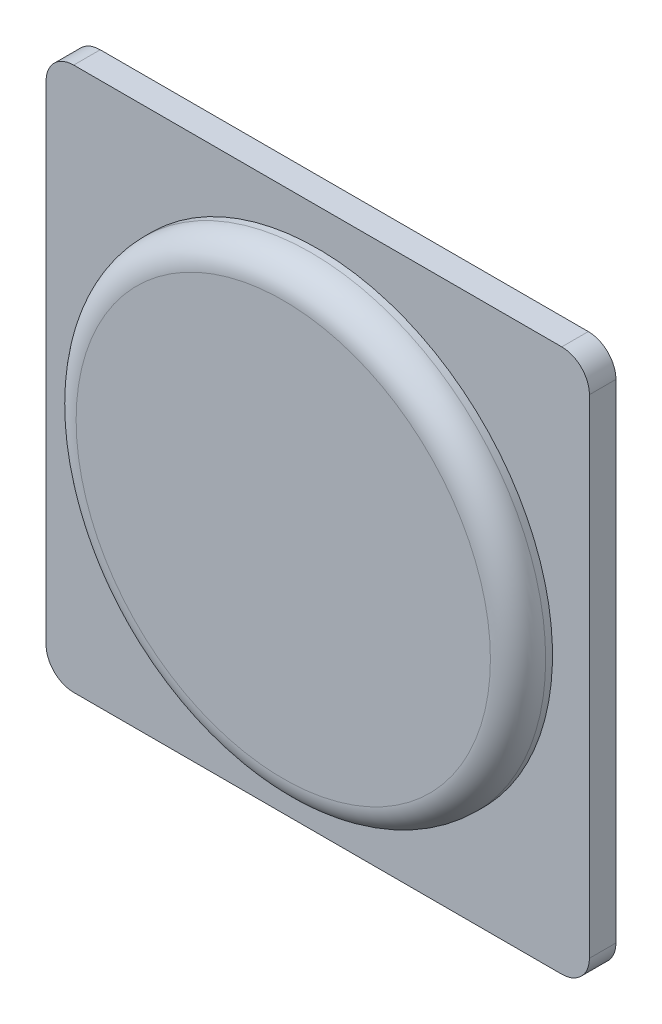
ISO-10303-21;
HEADER;
FILE_DESCRIPTION(('STEP AP214'),'2;1');
FILE_NAME('part.step','',(''),(''),'','','');
FILE_SCHEMA(('AUTOMOTIVE_DESIGN { 1 0 10303 214 1 1 1 1 }'));
ENDSEC;
DATA;
#1=APPLICATION_CONTEXT('core data for automotive mechanical design processes');
#2=APPLICATION_PROTOCOL_DEFINITION('international standard','automotive_design',2000,#1);
#3=PRODUCT_CONTEXT('',#1,'mechanical');
#4=PRODUCT('Part','Part','',(#3));
#5=PRODUCT_RELATED_PRODUCT_CATEGORY('part','',(#4));
#6=PRODUCT_DEFINITION_FORMATION('','',#4);
#7=PRODUCT_DEFINITION_CONTEXT('part definition',#1,'design');
#8=PRODUCT_DEFINITION('design','',#6,#7);
#9=PRODUCT_DEFINITION_SHAPE('','',#8);
#10=(LENGTH_UNIT() NAMED_UNIT(*) SI_UNIT(.MILLI.,.METRE.));
#11=(NAMED_UNIT(*) PLANE_ANGLE_UNIT() SI_UNIT($,.RADIAN.));
#12=(NAMED_UNIT(*) SI_UNIT($,.STERADIAN.) SOLID_ANGLE_UNIT());
#13=UNCERTAINTY_MEASURE_WITH_UNIT(LENGTH_MEASURE(1.E-05),#10,'distance_accuracy_value','');
#14=(GEOMETRIC_REPRESENTATION_CONTEXT(3) GLOBAL_UNCERTAINTY_ASSIGNED_CONTEXT((#13)) GLOBAL_UNIT_ASSIGNED_CONTEXT((#10,
#11,#12)) REPRESENTATION_CONTEXT('',''));
#15=CARTESIAN_POINT('',(0.,0.,0.));
#16=DIRECTION('',(0.,0.,1.));
#17=DIRECTION('',(1.,0.,0.));
#18=AXIS2_PLACEMENT_3D('',#15,#16,#17);
#19=CARTESIAN_POINT('',(0.,0.,3.8354));
#20=DIRECTION('',(0.,0.,1.));
#21=DIRECTION('',(1.,0.,0.));
#22=AXIS2_PLACEMENT_3D('',#19,#20,#21);
#23=TOROIDAL_SURFACE('',#22,23.8125,3.175);
#24=CARTESIAN_POINT('',(0.,0.,7.0104));
#25=DIRECTION('',(0.,0.,-1.));
#26=DIRECTION('',(1.,0.,0.));
#27=AXIS2_PLACEMENT_3D('',#24,#25,#26);
#28=CIRCLE('',#27,23.8125);
#29=CARTESIAN_POINT('',(23.8125,0.,7.0104));
#30=VERTEX_POINT('',#29);
#31=EDGE_CURVE('E116',#30,#30,#28,.F.);
#32=ORIENTED_EDGE('',*,*,#31,.F.);
#33=EDGE_LOOP('',(#32));
#34=FACE_BOUND('',#33,.T.);
#35=CARTESIAN_POINT('',(0.,0.,3.8354));
#36=DIRECTION('',(0.,0.,-1.));
#37=DIRECTION('',(-1.,0.,0.));
#38=AXIS2_PLACEMENT_3D('',#35,#36,#37);
#39=CIRCLE('',#38,26.9875);
#40=CARTESIAN_POINT('',(-26.9875,0.,3.8354));
#41=VERTEX_POINT('',#40);
#42=EDGE_CURVE('E203',#41,#41,#39,.T.);
#43=ORIENTED_EDGE('',*,*,#42,.F.);
#44=EDGE_LOOP('',(#43));
#45=FACE_BOUND('',#44,.T.);
#46=ADVANCED_FACE('F16',(#34,#45),#23,.T.);
#47=CARTESIAN_POINT('',(0.,0.,7.0104));
#48=DIRECTION('',(0.,0.,-1.));
#49=DIRECTION('',(-1.,0.,0.));
#50=AXIS2_PLACEMENT_3D('',#47,#48,#49);
#51=CYLINDRICAL_SURFACE('',#50,26.9875);
#52=ORIENTED_EDGE('',*,*,#42,.T.);
#53=EDGE_LOOP('',(#52));
#54=FACE_BOUND('',#53,.T.);
#55=CARTESIAN_POINT('',(0.,0.,3.048));
#56=DIRECTION('',(0.,0.,-1.));
#57=DIRECTION('',(-1.,0.,0.));
#58=AXIS2_PLACEMENT_3D('',#55,#56,#57);
#59=CIRCLE('',#58,26.9875);
#60=CARTESIAN_POINT('',(-26.9875,0.,3.048));
#61=VERTEX_POINT('',#60);
#62=EDGE_CURVE('E21',#61,#61,#59,.T.);
#63=ORIENTED_EDGE('',*,*,#62,.F.);
#64=EDGE_LOOP('',(#63));
#65=FACE_BOUND('',#64,.T.);
#66=ADVANCED_FACE('F130',(#54,#65),#51,.T.);
#67=CARTESIAN_POINT('',(0.,0.,7.0104));
#68=DIRECTION('',(0.,0.,1.));
#69=DIRECTION('',(1.,0.,0.));
#70=AXIS2_PLACEMENT_3D('',#67,#68,#69);
#71=PLANE('',#70);
#72=CARTESIAN_POINT('',(0.,0.,7.0104));
#73=DIRECTION('',(0.,0.,1.));
#74=DIRECTION('',(1.,0.,0.));
#75=AXIS2_PLACEMENT_3D('',#72,#73,#74);
#76=CIRCLE('',#75,0.0127);
#77=CARTESIAN_POINT('',(0.0127,0.,7.0104));
#78=VERTEX_POINT('',#77);
#79=EDGE_CURVE('E240',#78,#78,#76,.F.);
#80=ORIENTED_EDGE('',*,*,#79,.T.);
#81=EDGE_LOOP('',(#80));
#82=FACE_BOUND('',#81,.T.);
#83=ORIENTED_EDGE('',*,*,#31,.T.);
#84=EDGE_LOOP('',(#83));
#85=FACE_BOUND('',#84,.T.);
#86=ADVANCED_FACE('F121',(#82,#85),#71,.T.);
#87=CARTESIAN_POINT('',(0.,0.,3.048));
#88=DIRECTION('',(0.,0.,1.));
#89=DIRECTION('',(1.,0.,0.));
#90=AXIS2_PLACEMENT_3D('',#87,#88,#89);
#91=PLANE('',#90);
#92=CARTESIAN_POINT('',(24.1173,24.1173,3.048));
#93=DIRECTION('',(0.,0.,1.));
#94=DIRECTION('',(1.,0.,0.));
#95=AXIS2_PLACEMENT_3D('',#92,#93,#94);
#96=CIRCLE('',#95,0.0127);
#97=CARTESIAN_POINT('',(24.13,24.1173,3.048));
#98=VERTEX_POINT('',#97);
#99=EDGE_CURVE('E196',#98,#98,#96,.F.);
#100=ORIENTED_EDGE('',*,*,#99,.T.);
#101=EDGE_LOOP('',(#100));
#102=FACE_BOUND('',#101,.T.);
#103=CARTESIAN_POINT('',(-24.1173,24.1173,3.048));
#104=DIRECTION('',(0.,0.,1.));
#105=DIRECTION('',(1.,0.,0.));
#106=AXIS2_PLACEMENT_3D('',#103,#104,#105);
#107=CIRCLE('',#106,0.0127);
#108=CARTESIAN_POINT('',(-24.1046,24.1173,3.048));
#109=VERTEX_POINT('',#108);
#110=EDGE_CURVE('E200',#109,#109,#107,.F.);
#111=ORIENTED_EDGE('',*,*,#110,.T.);
#112=EDGE_LOOP('',(#111));
#113=FACE_BOUND('',#112,.T.);
#114=ORIENTED_EDGE('',*,*,#62,.T.);
#115=EDGE_LOOP('',(#114));
#116=FACE_BOUND('',#115,.T.);
#117=CARTESIAN_POINT('',(28.0543,28.0543,3.048));
#118=DIRECTION('',(0.,0.,1.));
#119=DIRECTION('',(1.,0.,0.));
#120=AXIS2_PLACEMENT_3D('',#117,#118,#119);
#121=CIRCLE('',#120,3.175);
#122=CARTESIAN_POINT('',(28.0543,31.2293,3.048));
#123=VERTEX_POINT('',#122);
#124=CARTESIAN_POINT('',(31.2293,28.0543,3.048));
#125=VERTEX_POINT('',#124);
#126=EDGE_CURVE('E246',#123,#125,#121,.F.);
#127=ORIENTED_EDGE('',*,*,#126,.F.);
#128=DIRECTION('',(1.,0.,0.));
#129=VECTOR('',#128,1.);
#130=CARTESIAN_POINT('',(-28.0543,31.2293,3.048));
#131=LINE('',#130,#129);
#132=CARTESIAN_POINT('',(-28.0543,31.2293,3.048));
#133=VERTEX_POINT('',#132);
#134=EDGE_CURVE('E269',#133,#123,#131,.T.);
#135=ORIENTED_EDGE('',*,*,#134,.F.);
#136=CARTESIAN_POINT('',(-28.0543,28.0543,3.048));
#137=DIRECTION('',(0.,0.,1.));
#138=DIRECTION('',(1.,0.,0.));
#139=AXIS2_PLACEMENT_3D('',#136,#137,#138);
#140=CIRCLE('',#139,3.175);
#141=CARTESIAN_POINT('',(-31.2293,28.0543,3.048));
#142=VERTEX_POINT('',#141);
#143=EDGE_CURVE('E99',#142,#133,#140,.F.);
#144=ORIENTED_EDGE('',*,*,#143,.F.);
#145=DIRECTION('',(0.,1.,0.));
#146=VECTOR('',#145,1.);
#147=CARTESIAN_POINT('',(-31.2293,-28.0543,3.048));
#148=LINE('',#147,#146);
#149=CARTESIAN_POINT('',(-31.2293,-28.0543,3.048));
#150=VERTEX_POINT('',#149);
#151=EDGE_CURVE('E94',#150,#142,#148,.T.);
#152=ORIENTED_EDGE('',*,*,#151,.F.);
#153=CARTESIAN_POINT('',(-28.0543,-28.0543,3.048));
#154=DIRECTION('',(0.,0.,1.));
#155=DIRECTION('',(1.,0.,0.));
#156=AXIS2_PLACEMENT_3D('',#153,#154,#155);
#157=CIRCLE('',#156,3.175);
#158=CARTESIAN_POINT('',(-28.0543,-31.2293,3.048));
#159=VERTEX_POINT('',#158);
#160=EDGE_CURVE('E85',#159,#150,#157,.F.);
#161=ORIENTED_EDGE('',*,*,#160,.F.);
#162=DIRECTION('',(1.,0.,0.));
#163=VECTOR('',#162,1.);
#164=CARTESIAN_POINT('',(28.0543,-31.2293,3.048));
#165=LINE('',#164,#163);
#166=CARTESIAN_POINT('',(28.0543,-31.2293,3.048));
#167=VERTEX_POINT('',#166);
#168=EDGE_CURVE('E80',#167,#159,#165,.F.);
#169=ORIENTED_EDGE('',*,*,#168,.F.);
#170=CARTESIAN_POINT('',(28.0543,-28.0543,3.048));
#171=DIRECTION('',(0.,0.,1.));
#172=DIRECTION('',(1.,0.,0.));
#173=AXIS2_PLACEMENT_3D('',#170,#171,#172);
#174=CIRCLE('',#173,3.175);
#175=CARTESIAN_POINT('',(31.2293,-28.0543,3.048));
#176=VERTEX_POINT('',#175);
#177=EDGE_CURVE('E250',#176,#167,#174,.F.);
#178=ORIENTED_EDGE('',*,*,#177,.F.);
#179=DIRECTION('',(0.,1.,0.));
#180=VECTOR('',#179,1.);
#181=CARTESIAN_POINT('',(31.2293,28.0543,3.048));
#182=LINE('',#181,#180);
#183=EDGE_CURVE('E254',#125,#176,#182,.F.);
#184=ORIENTED_EDGE('',*,*,#183,.F.);
#185=EDGE_LOOP('',(#127,#135,#144,#152,#161,#169,#178,#184));
#186=FACE_BOUND('',#185,.T.);
#187=ADVANCED_FACE('F97',(#102,#113,#116,#186),#91,.T.);
#188=CARTESIAN_POINT('',(-31.2293,-28.0543,0.));
#189=DIRECTION('',(-1.,0.,0.));
#190=DIRECTION('',(0.,0.,1.));
#191=AXIS2_PLACEMENT_3D('',#188,#189,#190);
#192=PLANE('',#191);
#193=DIRECTION('',(0.,1.,0.));
#194=VECTOR('',#193,1.);
#195=CARTESIAN_POINT('',(-31.2293,0.,0.));
#196=LINE('',#195,#194);
#197=CARTESIAN_POINT('',(-31.2293,28.0543,0.));
#198=VERTEX_POINT('',#197);
#199=CARTESIAN_POINT('',(-31.2293,-28.0543,0.));
#200=VERTEX_POINT('',#199);
#201=EDGE_CURVE('E106',#198,#200,#196,.F.);
#202=ORIENTED_EDGE('',*,*,#201,.T.);
#203=DIRECTION('',(0.,0.,1.));
#204=VECTOR('',#203,1.);
#205=CARTESIAN_POINT('',(-31.2293,-28.0543,0.));
#206=LINE('',#205,#204);
#207=EDGE_CURVE('E90',#150,#200,#206,.F.);
#208=ORIENTED_EDGE('',*,*,#207,.F.);
#209=ORIENTED_EDGE('',*,*,#151,.T.);
#210=DIRECTION('',(0.,0.,1.));
#211=VECTOR('',#210,1.);
#212=CARTESIAN_POINT('',(-31.2293,28.0543,0.));
#213=LINE('',#212,#211);
#214=EDGE_CURVE('E243',#198,#142,#213,.T.);
#215=ORIENTED_EDGE('',*,*,#214,.F.);
#216=EDGE_LOOP('',(#202,#208,#209,#215));
#217=FACE_BOUND('',#216,.T.);
#218=ADVANCED_FACE('F105',(#217),#192,.T.);
#219=CARTESIAN_POINT('',(-28.0543,-28.0543,0.));
#220=DIRECTION('',(0.,0.,1.));
#221=DIRECTION('',(1.,0.,0.));
#222=AXIS2_PLACEMENT_3D('',#219,#220,#221);
#223=CYLINDRICAL_SURFACE('',#222,3.175);
#224=CARTESIAN_POINT('',(-28.0543,-28.0543,0.));
#225=DIRECTION('',(0.,0.,1.));
#226=DIRECTION('',(1.,0.,0.));
#227=AXIS2_PLACEMENT_3D('',#224,#225,#226);
#228=CIRCLE('',#227,3.175);
#229=CARTESIAN_POINT('',(-28.0543,-31.2293,0.));
#230=VERTEX_POINT('',#229);
#231=EDGE_CURVE('E236',#200,#230,#228,.T.);
#232=ORIENTED_EDGE('',*,*,#231,.T.);
#233=DIRECTION('',(0.,0.,-1.));
#234=VECTOR('',#233,1.);
#235=CARTESIAN_POINT('',(-28.0543,-31.2293,0.));
#236=LINE('',#235,#234);
#237=EDGE_CURVE('E92',#159,#230,#236,.T.);
#238=ORIENTED_EDGE('',*,*,#237,.F.);
#239=ORIENTED_EDGE('',*,*,#160,.T.);
#240=ORIENTED_EDGE('',*,*,#207,.T.);
#241=EDGE_LOOP('',(#232,#238,#239,#240));
#242=FACE_BOUND('',#241,.T.);
#243=ADVANCED_FACE('F88',(#242),#223,.T.);
#244=CARTESIAN_POINT('',(28.0543,-31.2293,0.));
#245=DIRECTION('',(0.,-1.,0.));
#246=DIRECTION('',(0.,0.,-1.));
#247=AXIS2_PLACEMENT_3D('',#244,#245,#246);
#248=PLANE('',#247);
#249=DIRECTION('',(1.,0.,0.));
#250=VECTOR('',#249,1.);
#251=CARTESIAN_POINT('',(0.,-31.2293,0.));
#252=LINE('',#251,#250);
#253=CARTESIAN_POINT('',(28.0543,-31.2293,0.));
#254=VERTEX_POINT('',#253);
#255=EDGE_CURVE('E235',#230,#254,#252,.T.);
#256=ORIENTED_EDGE('',*,*,#255,.T.);
#257=DIRECTION('',(0.,0.,1.));
#258=VECTOR('',#257,1.);
#259=CARTESIAN_POINT('',(28.0543,-31.2293,0.));
#260=LINE('',#259,#258);
#261=EDGE_CURVE('E251',#167,#254,#260,.F.);
#262=ORIENTED_EDGE('',*,*,#261,.F.);
#263=ORIENTED_EDGE('',*,*,#168,.T.);
#264=ORIENTED_EDGE('',*,*,#237,.T.);
#265=EDGE_LOOP('',(#256,#262,#263,#264));
#266=FACE_BOUND('',#265,.T.);
#267=ADVANCED_FACE('F181',(#266),#248,.T.);
#268=CARTESIAN_POINT('',(28.0543,-28.0543,0.));
#269=DIRECTION('',(0.,0.,1.));
#270=DIRECTION('',(1.,0.,0.));
#271=AXIS2_PLACEMENT_3D('',#268,#269,#270);
#272=CYLINDRICAL_SURFACE('',#271,3.175);
#273=CARTESIAN_POINT('',(28.0543,-28.0543,0.));
#274=DIRECTION('',(0.,0.,1.));
#275=DIRECTION('',(1.,0.,0.));
#276=AXIS2_PLACEMENT_3D('',#273,#274,#275);
#277=CIRCLE('',#276,3.175);
#278=CARTESIAN_POINT('',(31.2293,-28.0543,0.));
#279=VERTEX_POINT('',#278);
#280=EDGE_CURVE('E232',#254,#279,#277,.T.);
#281=ORIENTED_EDGE('',*,*,#280,.T.);
#282=DIRECTION('',(0.,0.,-1.));
#283=VECTOR('',#282,1.);
#284=CARTESIAN_POINT('',(31.2293,-28.0543,0.));
#285=LINE('',#284,#283);
#286=EDGE_CURVE('E249',#176,#279,#285,.T.);
#287=ORIENTED_EDGE('',*,*,#286,.F.);
#288=ORIENTED_EDGE('',*,*,#177,.T.);
#289=ORIENTED_EDGE('',*,*,#261,.T.);
#290=EDGE_LOOP('',(#281,#287,#288,#289));
#291=FACE_BOUND('',#290,.T.);
#292=ADVANCED_FACE('F177',(#291),#272,.T.);
#293=CARTESIAN_POINT('',(31.2293,28.0543,0.));
#294=DIRECTION('',(1.,0.,0.));
#295=DIRECTION('',(0.,0.,-1.));
#296=AXIS2_PLACEMENT_3D('',#293,#294,#295);
#297=PLANE('',#296);
#298=DIRECTION('',(0.,1.,0.));
#299=VECTOR('',#298,1.);
#300=CARTESIAN_POINT('',(31.2293,0.,0.));
#301=LINE('',#300,#299);
#302=CARTESIAN_POINT('',(31.2293,28.0543,0.));
#303=VERTEX_POINT('',#302);
#304=EDGE_CURVE('E231',#279,#303,#301,.T.);
#305=ORIENTED_EDGE('',*,*,#304,.T.);
#306=DIRECTION('',(0.,0.,1.));
#307=VECTOR('',#306,1.);
#308=CARTESIAN_POINT('',(31.2293,28.0543,0.));
#309=LINE('',#308,#307);
#310=EDGE_CURVE('E248',#125,#303,#309,.F.);
#311=ORIENTED_EDGE('',*,*,#310,.F.);
#312=ORIENTED_EDGE('',*,*,#183,.T.);
#313=ORIENTED_EDGE('',*,*,#286,.T.);
#314=EDGE_LOOP('',(#305,#311,#312,#313));
#315=FACE_BOUND('',#314,.T.);
#316=ADVANCED_FACE('F173',(#315),#297,.T.);
#317=CARTESIAN_POINT('',(28.0543,28.0543,0.));
#318=DIRECTION('',(0.,0.,1.));
#319=DIRECTION('',(1.,0.,0.));
#320=AXIS2_PLACEMENT_3D('',#317,#318,#319);
#321=CYLINDRICAL_SURFACE('',#320,3.175);
#322=CARTESIAN_POINT('',(28.0543,28.0543,0.));
#323=DIRECTION('',(0.,0.,1.));
#324=DIRECTION('',(1.,0.,0.));
#325=AXIS2_PLACEMENT_3D('',#322,#323,#324);
#326=CIRCLE('',#325,3.175);
#327=CARTESIAN_POINT('',(28.0543,31.2293,0.));
#328=VERTEX_POINT('',#327);
#329=EDGE_CURVE('E228',#303,#328,#326,.T.);
#330=ORIENTED_EDGE('',*,*,#329,.T.);
#331=DIRECTION('',(0.,0.,1.));
#332=VECTOR('',#331,1.);
#333=CARTESIAN_POINT('',(28.0543,31.2293,0.));
#334=LINE('',#333,#332);
#335=EDGE_CURVE('E245',#123,#328,#334,.F.);
#336=ORIENTED_EDGE('',*,*,#335,.F.);
#337=ORIENTED_EDGE('',*,*,#126,.T.);
#338=ORIENTED_EDGE('',*,*,#310,.T.);
#339=EDGE_LOOP('',(#330,#336,#337,#338));
#340=FACE_BOUND('',#339,.T.);
#341=ADVANCED_FACE('F169',(#340),#321,.T.);
#342=CARTESIAN_POINT('',(-28.0543,31.2293,0.));
#343=DIRECTION('',(0.,1.,0.));
#344=DIRECTION('',(0.,0.,1.));
#345=AXIS2_PLACEMENT_3D('',#342,#343,#344);
#346=PLANE('',#345);
#347=DIRECTION('',(1.,0.,0.));
#348=VECTOR('',#347,1.);
#349=CARTESIAN_POINT('',(0.,31.2293,0.));
#350=LINE('',#349,#348);
#351=CARTESIAN_POINT('',(-28.0543,31.2293,0.));
#352=VERTEX_POINT('',#351);
#353=EDGE_CURVE('E227',#328,#352,#350,.F.);
#354=ORIENTED_EDGE('',*,*,#353,.T.);
#355=DIRECTION('',(0.,0.,1.));
#356=VECTOR('',#355,1.);
#357=CARTESIAN_POINT('',(-28.0543,31.2293,0.));
#358=LINE('',#357,#356);
#359=EDGE_CURVE('E36',#133,#352,#358,.F.);
#360=ORIENTED_EDGE('',*,*,#359,.F.);
#361=ORIENTED_EDGE('',*,*,#134,.T.);
#362=ORIENTED_EDGE('',*,*,#335,.T.);
#363=EDGE_LOOP('',(#354,#360,#361,#362));
#364=FACE_BOUND('',#363,.T.);
#365=ADVANCED_FACE('F166',(#364),#346,.T.);
#366=CARTESIAN_POINT('',(-28.0543,28.0543,0.));
#367=DIRECTION('',(0.,0.,1.));
#368=DIRECTION('',(1.,0.,0.));
#369=AXIS2_PLACEMENT_3D('',#366,#367,#368);
#370=CYLINDRICAL_SURFACE('',#369,3.175);
#371=CARTESIAN_POINT('',(-28.0543,28.0543,0.));
#372=DIRECTION('',(0.,0.,1.));
#373=DIRECTION('',(1.,0.,0.));
#374=AXIS2_PLACEMENT_3D('',#371,#372,#373);
#375=CIRCLE('',#374,3.175);
#376=EDGE_CURVE('E225',#352,#198,#375,.T.);
#377=ORIENTED_EDGE('',*,*,#376,.T.);
#378=ORIENTED_EDGE('',*,*,#214,.T.);
#379=ORIENTED_EDGE('',*,*,#143,.T.);
#380=ORIENTED_EDGE('',*,*,#359,.T.);
#381=EDGE_LOOP('',(#377,#378,#379,#380));
#382=FACE_BOUND('',#381,.T.);
#383=ADVANCED_FACE('F162',(#382),#370,.T.);
#384=CARTESIAN_POINT('',(0.,0.,0.));
#385=DIRECTION('',(0.,0.,1.));
#386=DIRECTION('',(1.,0.,0.));
#387=AXIS2_PLACEMENT_3D('',#384,#385,#386);
#388=CYLINDRICAL_SURFACE('',#387,0.0127);
#389=CARTESIAN_POINT('',(0.,0.,0.));
#390=DIRECTION('',(0.,0.,1.));
#391=DIRECTION('',(1.,0.,0.));
#392=AXIS2_PLACEMENT_3D('',#389,#390,#391);
#393=CIRCLE('',#392,0.0127);
#394=CARTESIAN_POINT('',(0.0127,0.,0.));
#395=VERTEX_POINT('',#394);
#396=EDGE_CURVE('E222',#395,#395,#393,.F.);
#397=ORIENTED_EDGE('',*,*,#396,.T.);
#398=EDGE_LOOP('',(#397));
#399=FACE_BOUND('',#398,.T.);
#400=ORIENTED_EDGE('',*,*,#79,.F.);
#401=EDGE_LOOP('',(#400));
#402=FACE_BOUND('',#401,.T.);
#403=ADVANCED_FACE('F158',(#399,#402),#388,.F.);
#404=CARTESIAN_POINT('',(24.1173,24.1173,0.));
#405=DIRECTION('',(0.,0.,1.));
#406=DIRECTION('',(1.,0.,0.));
#407=AXIS2_PLACEMENT_3D('',#404,#405,#406);
#408=CYLINDRICAL_SURFACE('',#407,0.0127);
#409=CARTESIAN_POINT('',(24.1173,24.1173,0.));
#410=DIRECTION('',(0.,0.,1.));
#411=DIRECTION('',(1.,0.,0.));
#412=AXIS2_PLACEMENT_3D('',#409,#410,#411);
#413=CIRCLE('',#412,0.0127);
#414=CARTESIAN_POINT('',(24.13,24.1173,0.));
#415=VERTEX_POINT('',#414);
#416=EDGE_CURVE('E27',#415,#415,#413,.F.);
#417=ORIENTED_EDGE('',*,*,#416,.T.);
#418=EDGE_LOOP('',(#417));
#419=FACE_BOUND('',#418,.T.);
#420=ORIENTED_EDGE('',*,*,#99,.F.);
#421=EDGE_LOOP('',(#420));
#422=FACE_BOUND('',#421,.T.);
#423=ADVANCED_FACE('F150',(#419,#422),#408,.F.);
#424=CARTESIAN_POINT('',(-24.1173,24.1173,0.));
#425=DIRECTION('',(0.,0.,1.));
#426=DIRECTION('',(1.,0.,0.));
#427=AXIS2_PLACEMENT_3D('',#424,#425,#426);
#428=CYLINDRICAL_SURFACE('',#427,0.0127);
#429=CARTESIAN_POINT('',(-24.1173,24.1173,0.));
#430=DIRECTION('',(0.,0.,1.));
#431=DIRECTION('',(1.,0.,0.));
#432=AXIS2_PLACEMENT_3D('',#429,#430,#431);
#433=CIRCLE('',#432,0.0127);
#434=CARTESIAN_POINT('',(-24.1046,24.1173,0.));
#435=VERTEX_POINT('',#434);
#436=EDGE_CURVE('E11',#435,#435,#433,.F.);
#437=ORIENTED_EDGE('',*,*,#436,.T.);
#438=EDGE_LOOP('',(#437));
#439=FACE_BOUND('',#438,.T.);
#440=ORIENTED_EDGE('',*,*,#110,.F.);
#441=EDGE_LOOP('',(#440));
#442=FACE_BOUND('',#441,.T.);
#443=ADVANCED_FACE('F144',(#439,#442),#428,.F.);
#444=CARTESIAN_POINT('',(0.,0.,0.));
#445=DIRECTION('',(0.,0.,1.));
#446=DIRECTION('',(1.,0.,0.));
#447=AXIS2_PLACEMENT_3D('',#444,#445,#446);
#448=PLANE('',#447);
#449=ORIENTED_EDGE('',*,*,#436,.F.);
#450=EDGE_LOOP('',(#449));
#451=FACE_BOUND('',#450,.T.);
#452=ORIENTED_EDGE('',*,*,#416,.F.);
#453=EDGE_LOOP('',(#452));
#454=FACE_BOUND('',#453,.T.);
#455=ORIENTED_EDGE('',*,*,#396,.F.);
#456=EDGE_LOOP('',(#455));
#457=FACE_BOUND('',#456,.T.);
#458=ORIENTED_EDGE('',*,*,#353,.F.);
#459=ORIENTED_EDGE('',*,*,#329,.F.);
#460=ORIENTED_EDGE('',*,*,#304,.F.);
#461=ORIENTED_EDGE('',*,*,#280,.F.);
#462=ORIENTED_EDGE('',*,*,#255,.F.);
#463=ORIENTED_EDGE('',*,*,#231,.F.);
#464=ORIENTED_EDGE('',*,*,#201,.F.);
#465=ORIENTED_EDGE('',*,*,#376,.F.);
#466=EDGE_LOOP('',(#458,#459,#460,#461,#462,#463,#464,#465));
#467=FACE_BOUND('',#466,.T.);
#468=ADVANCED_FACE('F142',(#451,#454,#457,#467),#448,.F.);
#469=CLOSED_SHELL('',(#46,#66,#86,#187,#218,#243,#267,#292,#316,#341,#365,#383,#403,#423,#443,#468));
#470=MANIFOLD_SOLID_BREP('B1',#469);
#471=ADVANCED_BREP_SHAPE_REPRESENTATION('',(#18,#470),#14);
#472=SHAPE_DEFINITION_REPRESENTATION(#9,#471);
ENDSEC;
END-ISO-10303-21;
